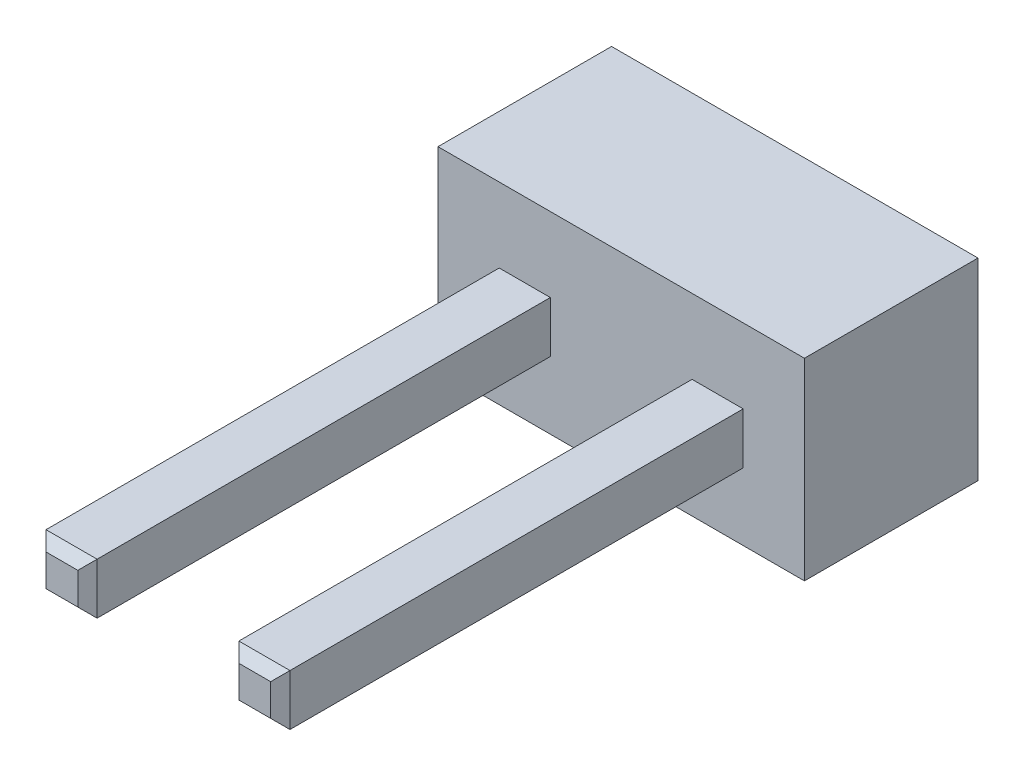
ISO-10303-21;
HEADER;
FILE_DESCRIPTION(('STEP AP214'),'2;1');
FILE_NAME('part.step','',(''),(''),'','','');
FILE_SCHEMA(('AUTOMOTIVE_DESIGN { 1 0 10303 214 1 1 1 1 }'));
ENDSEC;
DATA;
#1=APPLICATION_CONTEXT('core data for automotive mechanical design processes');
#2=APPLICATION_PROTOCOL_DEFINITION('international standard','automotive_design',2000,#1);
#3=PRODUCT_CONTEXT('',#1,'mechanical');
#4=PRODUCT('Part','Part','',(#3));
#5=PRODUCT_RELATED_PRODUCT_CATEGORY('part','',(#4));
#6=PRODUCT_DEFINITION_FORMATION('','',#4);
#7=PRODUCT_DEFINITION_CONTEXT('part definition',#1,'design');
#8=PRODUCT_DEFINITION('design','',#6,#7);
#9=PRODUCT_DEFINITION_SHAPE('','',#8);
#10=(LENGTH_UNIT() NAMED_UNIT(*) SI_UNIT(.MILLI.,.METRE.));
#11=(NAMED_UNIT(*) PLANE_ANGLE_UNIT() SI_UNIT($,.RADIAN.));
#12=(NAMED_UNIT(*) SI_UNIT($,.STERADIAN.) SOLID_ANGLE_UNIT());
#13=UNCERTAINTY_MEASURE_WITH_UNIT(LENGTH_MEASURE(1.E-05),#10,'distance_accuracy_value','');
#14=(GEOMETRIC_REPRESENTATION_CONTEXT(3) GLOBAL_UNCERTAINTY_ASSIGNED_CONTEXT((#13)) GLOBAL_UNIT_ASSIGNED_CONTEXT((#10,
#11,#12)) REPRESENTATION_CONTEXT('',''));
#15=CARTESIAN_POINT('',(0.,0.,0.));
#16=DIRECTION('',(0.,0.,1.));
#17=DIRECTION('',(1.,0.,0.));
#18=AXIS2_PLACEMENT_3D('',#15,#16,#17);
#19=CARTESIAN_POINT('',(-2.74955,1.55928543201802,7.239));
#20=DIRECTION('',(-0.707106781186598,0.,0.707106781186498));
#21=DIRECTION('',(0.707106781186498,0.,0.707106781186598));
#22=AXIS2_PLACEMENT_3D('',#19,#20,#21);
#23=PLANE('',#22);
#24=DIRECTION('',(0.,1.,0.));
#25=VECTOR('',#24,1.);
#26=CARTESIAN_POINT('',(-2.87655,1.55928543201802,7.11199999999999));
#27=LINE('',#26,#25);
#28=CARTESIAN_POINT('',(-2.87654999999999,1.55928543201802,7.11199999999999));
#29=VERTEX_POINT('',#28);
#30=CARTESIAN_POINT('',(-2.87655,0.886185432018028,7.11199999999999));
#31=VERTEX_POINT('',#30);
#32=EDGE_CURVE('E152',#29,#31,#27,.F.);
#33=ORIENTED_EDGE('',*,*,#32,.T.);
#34=DIRECTION('',(-0.577350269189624,-0.577350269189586,-0.577350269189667));
#35=VECTOR('',#34,1.);
#36=CARTESIAN_POINT('',(-2.74955,1.01318543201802,7.239));
#37=LINE('',#36,#35);
#38=CARTESIAN_POINT('',(-2.74955,1.01318543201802,7.239));
#39=VERTEX_POINT('',#38);
#40=EDGE_CURVE('E143',#39,#31,#37,.T.);
#41=ORIENTED_EDGE('',*,*,#40,.F.);
#42=DIRECTION('',(0.,1.,0.));
#43=VECTOR('',#42,1.);
#44=CARTESIAN_POINT('',(-2.74955,1.55928543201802,7.239));
#45=LINE('',#44,#43);
#46=CARTESIAN_POINT('',(-2.74955,1.43228543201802,7.239));
#47=VERTEX_POINT('',#46);
#48=EDGE_CURVE('E20',#47,#39,#45,.F.);
#49=ORIENTED_EDGE('',*,*,#48,.F.);
#50=DIRECTION('',(0.577350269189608,-0.577350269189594,0.577350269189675));
#51=VECTOR('',#50,1.);
#52=CARTESIAN_POINT('',(-2.87655,1.55928543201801,7.11199999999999));
#53=LINE('',#52,#51);
#54=EDGE_CURVE('E133',#29,#47,#53,.T.);
#55=ORIENTED_EDGE('',*,*,#54,.F.);
#56=EDGE_LOOP('',(#33,#41,#49,#55));
#57=FACE_BOUND('',#56,.T.);
#58=ADVANCED_FACE('F17',(#57),#23,.T.);
#59=CARTESIAN_POINT('',(-0.20955,0.886185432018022,7.239));
#60=DIRECTION('',(-0.707106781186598,0.,0.707106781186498));
#61=DIRECTION('',(0.707106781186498,0.,0.707106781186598));
#62=AXIS2_PLACEMENT_3D('',#59,#60,#61);
#63=PLANE('',#62);
#64=DIRECTION('',(0.,1.,0.));
#65=VECTOR('',#64,1.);
#66=CARTESIAN_POINT('',(-0.20955,0.886185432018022,7.239));
#67=LINE('',#66,#65);
#68=CARTESIAN_POINT('',(-0.20955,1.43228543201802,7.239));
#69=VERTEX_POINT('',#68);
#70=CARTESIAN_POINT('',(-0.20955,1.01318543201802,7.239));
#71=VERTEX_POINT('',#70);
#72=EDGE_CURVE('E156',#69,#71,#67,.F.);
#73=ORIENTED_EDGE('',*,*,#72,.F.);
#74=DIRECTION('',(0.577350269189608,-0.577350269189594,0.577350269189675));
#75=VECTOR('',#74,1.);
#76=CARTESIAN_POINT('',(-0.336549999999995,1.55928543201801,7.11199999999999));
#77=LINE('',#76,#75);
#78=CARTESIAN_POINT('',(-0.336549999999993,1.55928543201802,7.11199999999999));
#79=VERTEX_POINT('',#78);
#80=EDGE_CURVE('E160',#79,#69,#77,.T.);
#81=ORIENTED_EDGE('',*,*,#80,.F.);
#82=DIRECTION('',(0.,1.,0.));
#83=VECTOR('',#82,1.);
#84=CARTESIAN_POINT('',(-0.33655,1.55928543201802,7.11199999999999));
#85=LINE('',#84,#83);
#86=CARTESIAN_POINT('',(-0.336549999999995,0.886185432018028,7.11199999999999));
#87=VERTEX_POINT('',#86);
#88=EDGE_CURVE('E168',#79,#87,#85,.F.);
#89=ORIENTED_EDGE('',*,*,#88,.T.);
#90=DIRECTION('',(-0.577350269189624,-0.577350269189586,-0.577350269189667));
#91=VECTOR('',#90,1.);
#92=CARTESIAN_POINT('',(-0.20955,1.01318543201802,7.239));
#93=LINE('',#92,#91);
#94=EDGE_CURVE('E166',#71,#87,#93,.T.);
#95=ORIENTED_EDGE('',*,*,#94,.F.);
#96=EDGE_LOOP('',(#73,#81,#89,#95));
#97=FACE_BOUND('',#96,.T.);
#98=ADVANCED_FACE('F358',(#97),#63,.T.);
#99=CARTESIAN_POINT('',(-2.87655,1.55928543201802,7.239));
#100=DIRECTION('',(0.,0.,1.));
#101=DIRECTION('',(1.,0.,0.));
#102=AXIS2_PLACEMENT_3D('',#99,#100,#101);
#103=PLANE('',#102);
#104=DIRECTION('',(1.,0.,0.));
#105=VECTOR('',#104,1.);
#106=CARTESIAN_POINT('',(-2.87655,1.01318543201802,7.239));
#107=LINE('',#106,#105);
#108=CARTESIAN_POINT('',(-2.33045,1.01318543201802,7.239));
#109=VERTEX_POINT('',#108);
#110=EDGE_CURVE('E147',#109,#39,#107,.F.);
#111=ORIENTED_EDGE('',*,*,#110,.F.);
#112=DIRECTION('',(0.,1.,0.));
#113=VECTOR('',#112,1.);
#114=CARTESIAN_POINT('',(-2.33045,1.55928543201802,7.239));
#115=LINE('',#114,#113);
#116=CARTESIAN_POINT('',(-2.33045,1.43228543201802,7.239));
#117=VERTEX_POINT('',#116);
#118=EDGE_CURVE('E146',#117,#109,#115,.F.);
#119=ORIENTED_EDGE('',*,*,#118,.F.);
#120=DIRECTION('',(1.,0.,0.));
#121=VECTOR('',#120,1.);
#122=CARTESIAN_POINT('',(-2.87655,1.43228543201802,7.239));
#123=LINE('',#122,#121);
#124=EDGE_CURVE('E136',#47,#117,#123,.T.);
#125=ORIENTED_EDGE('',*,*,#124,.F.);
#126=ORIENTED_EDGE('',*,*,#48,.T.);
#127=EDGE_LOOP('',(#111,#119,#125,#126));
#128=FACE_BOUND('',#127,.T.);
#129=ADVANCED_FACE('F145',(#128),#103,.T.);
#130=CARTESIAN_POINT('',(-2.87655,1.43228543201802,7.239));
#131=DIRECTION('',(0.,0.707106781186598,0.707106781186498));
#132=DIRECTION('',(0.,-0.707106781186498,0.707106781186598));
#133=AXIS2_PLACEMENT_3D('',#130,#131,#132);
#134=PLANE('',#133);
#135=ORIENTED_EDGE('',*,*,#124,.T.);
#136=DIRECTION('',(-0.577350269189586,-0.577350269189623,0.577350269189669));
#137=VECTOR('',#136,1.);
#138=CARTESIAN_POINT('',(-2.20345000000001,1.55928543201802,7.11199999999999));
#139=LINE('',#138,#137);
#140=CARTESIAN_POINT('',(-2.20345,1.55928543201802,7.11199999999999));
#141=VERTEX_POINT('',#140);
#142=EDGE_CURVE('E173',#141,#117,#139,.T.);
#143=ORIENTED_EDGE('',*,*,#142,.F.);
#144=DIRECTION('',(1.,0.,0.));
#145=VECTOR('',#144,1.);
#146=CARTESIAN_POINT('',(-2.87655,1.55928543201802,7.11199999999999));
#147=LINE('',#146,#145);
#148=EDGE_CURVE('E138',#141,#29,#147,.F.);
#149=ORIENTED_EDGE('',*,*,#148,.T.);
#150=ORIENTED_EDGE('',*,*,#54,.T.);
#151=EDGE_LOOP('',(#135,#143,#149,#150));
#152=FACE_BOUND('',#151,.T.);
#153=ADVANCED_FACE('F134',(#152),#134,.T.);
#154=CARTESIAN_POINT('',(-2.87655,1.01318543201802,7.239));
#155=DIRECTION('',(0.,-0.707106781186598,0.707106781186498));
#156=DIRECTION('',(0.,-0.707106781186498,-0.707106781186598));
#157=AXIS2_PLACEMENT_3D('',#154,#155,#156);
#158=PLANE('',#157);
#159=ORIENTED_EDGE('',*,*,#110,.T.);
#160=ORIENTED_EDGE('',*,*,#40,.T.);
#161=DIRECTION('',(1.,0.,0.));
#162=VECTOR('',#161,1.);
#163=CARTESIAN_POINT('',(-2.87655,0.886185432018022,7.11199999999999));
#164=LINE('',#163,#162);
#165=CARTESIAN_POINT('',(-2.20345,0.886185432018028,7.11199999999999));
#166=VERTEX_POINT('',#165);
#167=EDGE_CURVE('E184',#31,#166,#164,.T.);
#168=ORIENTED_EDGE('',*,*,#167,.T.);
#169=DIRECTION('',(0.577350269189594,-0.577350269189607,-0.577350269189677));
#170=VECTOR('',#169,1.);
#171=CARTESIAN_POINT('',(-2.33045,1.01318543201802,7.239));
#172=LINE('',#171,#170);
#173=EDGE_CURVE('E176',#109,#166,#172,.T.);
#174=ORIENTED_EDGE('',*,*,#173,.F.);
#175=EDGE_LOOP('',(#159,#160,#168,#174));
#176=FACE_BOUND('',#175,.T.);
#177=ADVANCED_FACE('F350',(#176),#158,.T.);
#178=CARTESIAN_POINT('',(-2.87655,1.55928543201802,7.239));
#179=DIRECTION('',(1.,0.,0.));
#180=DIRECTION('',(0.,0.,-1.));
#181=AXIS2_PLACEMENT_3D('',#178,#179,#180);
#182=PLANE('',#181);
#183=DIRECTION('',(0.,1.,0.));
#184=VECTOR('',#183,1.);
#185=CARTESIAN_POINT('',(-2.87655,1.55928543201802,1.143));
#186=LINE('',#185,#184);
#187=CARTESIAN_POINT('',(-2.87655,0.886185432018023,1.143));
#188=VERTEX_POINT('',#187);
#189=CARTESIAN_POINT('',(-2.87655,1.55928543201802,1.143));
#190=VERTEX_POINT('',#189);
#191=EDGE_CURVE('E154',#188,#190,#186,.T.);
#192=ORIENTED_EDGE('',*,*,#191,.F.);
#193=DIRECTION('',(0.,0.,1.));
#194=VECTOR('',#193,1.);
#195=CARTESIAN_POINT('',(-2.87655,0.886185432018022,7.239));
#196=LINE('',#195,#194);
#197=EDGE_CURVE('E190',#188,#31,#196,.T.);
#198=ORIENTED_EDGE('',*,*,#197,.T.);
#199=ORIENTED_EDGE('',*,*,#32,.F.);
#200=DIRECTION('',(0.,0.,-1.));
#201=VECTOR('',#200,1.);
#202=CARTESIAN_POINT('',(-2.87655,1.55928543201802,7.239));
#203=LINE('',#202,#201);
#204=EDGE_CURVE('E179',#29,#190,#203,.T.);
#205=ORIENTED_EDGE('',*,*,#204,.T.);
#206=EDGE_LOOP('',(#192,#198,#199,#205));
#207=FACE_BOUND('',#206,.T.);
#208=ADVANCED_FACE('F346',(#207),#182,.F.);
#209=CARTESIAN_POINT('',(-0.33655,0.886185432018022,7.239));
#210=DIRECTION('',(0.,0.,1.));
#211=DIRECTION('',(1.,0.,0.));
#212=AXIS2_PLACEMENT_3D('',#209,#210,#211);
#213=PLANE('',#212);
#214=ORIENTED_EDGE('',*,*,#72,.T.);
#215=DIRECTION('',(1.,0.,0.));
#216=VECTOR('',#215,1.);
#217=CARTESIAN_POINT('',(-0.33655,1.01318543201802,7.239));
#218=LINE('',#217,#216);
#219=CARTESIAN_POINT('',(0.20955,1.01318543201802,7.239));
#220=VERTEX_POINT('',#219);
#221=EDGE_CURVE('E163',#220,#71,#218,.F.);
#222=ORIENTED_EDGE('',*,*,#221,.F.);
#223=DIRECTION('',(0.,1.,0.));
#224=VECTOR('',#223,1.);
#225=CARTESIAN_POINT('',(0.20955,0.886185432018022,7.239));
#226=LINE('',#225,#224);
#227=CARTESIAN_POINT('',(0.20955,1.43228543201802,7.239));
#228=VERTEX_POINT('',#227);
#229=EDGE_CURVE('E196',#228,#220,#226,.F.);
#230=ORIENTED_EDGE('',*,*,#229,.F.);
#231=DIRECTION('',(1.,0.,0.));
#232=VECTOR('',#231,1.);
#233=CARTESIAN_POINT('',(-0.33655,1.43228543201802,7.239));
#234=LINE('',#233,#232);
#235=EDGE_CURVE('E158',#69,#228,#234,.T.);
#236=ORIENTED_EDGE('',*,*,#235,.F.);
#237=EDGE_LOOP('',(#214,#222,#230,#236));
#238=FACE_BOUND('',#237,.T.);
#239=ADVANCED_FACE('F342',(#238),#213,.T.);
#240=CARTESIAN_POINT('',(-0.33655,1.43228543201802,7.239));
#241=DIRECTION('',(0.,0.707106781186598,0.707106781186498));
#242=DIRECTION('',(0.,-0.707106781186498,0.707106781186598));
#243=AXIS2_PLACEMENT_3D('',#240,#241,#242);
#244=PLANE('',#243);
#245=DIRECTION('',(1.,0.,0.));
#246=VECTOR('',#245,1.);
#247=CARTESIAN_POINT('',(-0.33655,1.55928543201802,7.11199999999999));
#248=LINE('',#247,#246);
#249=CARTESIAN_POINT('',(0.336549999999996,1.55928543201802,7.11199999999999));
#250=VERTEX_POINT('',#249);
#251=EDGE_CURVE('E200',#250,#79,#248,.F.);
#252=ORIENTED_EDGE('',*,*,#251,.T.);
#253=ORIENTED_EDGE('',*,*,#80,.T.);
#254=ORIENTED_EDGE('',*,*,#235,.T.);
#255=DIRECTION('',(-0.577350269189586,-0.577350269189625,0.577350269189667));
#256=VECTOR('',#255,1.);
#257=CARTESIAN_POINT('',(0.33654999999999,1.55928543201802,7.11199999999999));
#258=LINE('',#257,#256);
#259=EDGE_CURVE('E193',#250,#228,#258,.T.);
#260=ORIENTED_EDGE('',*,*,#259,.F.);
#261=EDGE_LOOP('',(#252,#253,#254,#260));
#262=FACE_BOUND('',#261,.T.);
#263=ADVANCED_FACE('F338',(#262),#244,.T.);
#264=CARTESIAN_POINT('',(-0.33655,1.01318543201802,7.239));
#265=DIRECTION('',(0.,-0.707106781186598,0.707106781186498));
#266=DIRECTION('',(0.,-0.707106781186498,-0.707106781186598));
#267=AXIS2_PLACEMENT_3D('',#264,#265,#266);
#268=PLANE('',#267);
#269=ORIENTED_EDGE('',*,*,#221,.T.);
#270=ORIENTED_EDGE('',*,*,#94,.T.);
#271=DIRECTION('',(1.,0.,0.));
#272=VECTOR('',#271,1.);
#273=CARTESIAN_POINT('',(-0.33655,0.886185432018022,7.11199999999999));
#274=LINE('',#273,#272);
#275=CARTESIAN_POINT('',(0.336549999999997,0.886185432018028,7.11199999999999));
#276=VERTEX_POINT('',#275);
#277=EDGE_CURVE('E208',#87,#276,#274,.T.);
#278=ORIENTED_EDGE('',*,*,#277,.T.);
#279=DIRECTION('',(0.577350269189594,-0.577350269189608,-0.577350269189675));
#280=VECTOR('',#279,1.);
#281=CARTESIAN_POINT('',(0.20955,1.01318543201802,7.239));
#282=LINE('',#281,#280);
#283=EDGE_CURVE('E198',#220,#276,#282,.T.);
#284=ORIENTED_EDGE('',*,*,#283,.F.);
#285=EDGE_LOOP('',(#269,#270,#278,#284));
#286=FACE_BOUND('',#285,.T.);
#287=ADVANCED_FACE('F334',(#286),#268,.T.);
#288=CARTESIAN_POINT('',(-0.33655,1.55928543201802,7.239));
#289=DIRECTION('',(1.,0.,0.));
#290=DIRECTION('',(0.,0.,-1.));
#291=AXIS2_PLACEMENT_3D('',#288,#289,#290);
#292=PLANE('',#291);
#293=DIRECTION('',(0.,1.,0.));
#294=VECTOR('',#293,1.);
#295=CARTESIAN_POINT('',(-0.33655,1.55928543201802,1.143));
#296=LINE('',#295,#294);
#297=CARTESIAN_POINT('',(-0.33655,0.886185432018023,1.143));
#298=VERTEX_POINT('',#297);
#299=CARTESIAN_POINT('',(-0.336549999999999,1.55928543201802,1.143));
#300=VERTEX_POINT('',#299);
#301=EDGE_CURVE('E171',#298,#300,#296,.T.);
#302=ORIENTED_EDGE('',*,*,#301,.F.);
#303=DIRECTION('',(0.,0.,1.));
#304=VECTOR('',#303,1.);
#305=CARTESIAN_POINT('',(-0.33655,0.886185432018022,7.239));
#306=LINE('',#305,#304);
#307=EDGE_CURVE('E214',#298,#87,#306,.T.);
#308=ORIENTED_EDGE('',*,*,#307,.T.);
#309=ORIENTED_EDGE('',*,*,#88,.F.);
#310=DIRECTION('',(0.,0.,-1.));
#311=VECTOR('',#310,1.);
#312=CARTESIAN_POINT('',(-0.336549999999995,1.55928543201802,7.239));
#313=LINE('',#312,#311);
#314=EDGE_CURVE('E203',#79,#300,#313,.T.);
#315=ORIENTED_EDGE('',*,*,#314,.T.);
#316=EDGE_LOOP('',(#302,#308,#309,#315));
#317=FACE_BOUND('',#316,.T.);
#318=ADVANCED_FACE('F330',(#317),#292,.F.);
#319=CARTESIAN_POINT('',(-2.33045,1.55928543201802,7.239));
#320=DIRECTION('',(0.707106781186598,0.,0.707106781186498));
#321=DIRECTION('',(0.707106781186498,0.,-0.707106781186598));
#322=AXIS2_PLACEMENT_3D('',#319,#320,#321);
#323=PLANE('',#322);
#324=ORIENTED_EDGE('',*,*,#118,.T.);
#325=ORIENTED_EDGE('',*,*,#173,.T.);
#326=DIRECTION('',(0.,1.,0.));
#327=VECTOR('',#326,1.);
#328=CARTESIAN_POINT('',(-2.20345,1.55928543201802,7.11199999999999));
#329=LINE('',#328,#327);
#330=EDGE_CURVE('E217',#166,#141,#329,.T.);
#331=ORIENTED_EDGE('',*,*,#330,.T.);
#332=ORIENTED_EDGE('',*,*,#142,.T.);
#333=EDGE_LOOP('',(#324,#325,#331,#332));
#334=FACE_BOUND('',#333,.T.);
#335=ADVANCED_FACE('F326',(#334),#323,.T.);
#336=CARTESIAN_POINT('',(-2.87655,1.55928543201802,7.239));
#337=DIRECTION('',(0.,-1.,0.));
#338=DIRECTION('',(0.,0.,-1.));
#339=AXIS2_PLACEMENT_3D('',#336,#337,#338);
#340=PLANE('',#339);
#341=DIRECTION('',(1.,0.,0.));
#342=VECTOR('',#341,1.);
#343=CARTESIAN_POINT('',(-2.87655,1.55928543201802,1.143));
#344=LINE('',#343,#342);
#345=CARTESIAN_POINT('',(-2.20345,1.55928543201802,1.143));
#346=VERTEX_POINT('',#345);
#347=EDGE_CURVE('E182',#190,#346,#344,.T.);
#348=ORIENTED_EDGE('',*,*,#347,.F.);
#349=ORIENTED_EDGE('',*,*,#204,.F.);
#350=ORIENTED_EDGE('',*,*,#148,.F.);
#351=DIRECTION('',(0.,0.,1.));
#352=VECTOR('',#351,1.);
#353=CARTESIAN_POINT('',(-2.20345,1.55928543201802,7.239));
#354=LINE('',#353,#352);
#355=EDGE_CURVE('E220',#141,#346,#354,.F.);
#356=ORIENTED_EDGE('',*,*,#355,.T.);
#357=EDGE_LOOP('',(#348,#349,#350,#356));
#358=FACE_BOUND('',#357,.T.);
#359=ADVANCED_FACE('F322',(#358),#340,.F.);
#360=CARTESIAN_POINT('',(-2.87655,0.886185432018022,7.239));
#361=DIRECTION('',(0.,1.,0.));
#362=DIRECTION('',(0.,0.,1.));
#363=AXIS2_PLACEMENT_3D('',#360,#361,#362);
#364=PLANE('',#363);
#365=DIRECTION('',(1.,0.,0.));
#366=VECTOR('',#365,1.);
#367=CARTESIAN_POINT('',(-2.87655,0.886185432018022,1.143));
#368=LINE('',#367,#366);
#369=CARTESIAN_POINT('',(-2.20345,0.886185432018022,1.143));
#370=VERTEX_POINT('',#369);
#371=EDGE_CURVE('E187',#370,#188,#368,.F.);
#372=ORIENTED_EDGE('',*,*,#371,.F.);
#373=DIRECTION('',(0.,0.,1.));
#374=VECTOR('',#373,1.);
#375=CARTESIAN_POINT('',(-2.20345,0.886185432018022,7.239));
#376=LINE('',#375,#374);
#377=EDGE_CURVE('E223',#370,#166,#376,.T.);
#378=ORIENTED_EDGE('',*,*,#377,.T.);
#379=ORIENTED_EDGE('',*,*,#167,.F.);
#380=ORIENTED_EDGE('',*,*,#197,.F.);
#381=EDGE_LOOP('',(#372,#378,#379,#380));
#382=FACE_BOUND('',#381,.T.);
#383=ADVANCED_FACE('F318',(#382),#364,.F.);
#384=CARTESIAN_POINT('',(0.20955,0.886185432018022,7.239));
#385=DIRECTION('',(0.707106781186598,0.,0.707106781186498));
#386=DIRECTION('',(0.707106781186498,0.,-0.707106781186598));
#387=AXIS2_PLACEMENT_3D('',#384,#385,#386);
#388=PLANE('',#387);
#389=ORIENTED_EDGE('',*,*,#229,.T.);
#390=ORIENTED_EDGE('',*,*,#283,.T.);
#391=DIRECTION('',(0.,1.,0.));
#392=VECTOR('',#391,1.);
#393=CARTESIAN_POINT('',(0.33655,1.55928543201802,7.11199999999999));
#394=LINE('',#393,#392);
#395=EDGE_CURVE('E226',#276,#250,#394,.T.);
#396=ORIENTED_EDGE('',*,*,#395,.T.);
#397=ORIENTED_EDGE('',*,*,#259,.T.);
#398=EDGE_LOOP('',(#389,#390,#396,#397));
#399=FACE_BOUND('',#398,.T.);
#400=ADVANCED_FACE('F314',(#399),#388,.T.);
#401=CARTESIAN_POINT('',(-0.33655,1.55928543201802,7.239));
#402=DIRECTION('',(0.,-1.,0.));
#403=DIRECTION('',(0.,0.,-1.));
#404=AXIS2_PLACEMENT_3D('',#401,#402,#403);
#405=PLANE('',#404);
#406=DIRECTION('',(1.,0.,0.));
#407=VECTOR('',#406,1.);
#408=CARTESIAN_POINT('',(-0.33655,1.55928543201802,1.143));
#409=LINE('',#408,#407);
#410=CARTESIAN_POINT('',(0.33655,1.55928543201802,1.143));
#411=VERTEX_POINT('',#410);
#412=EDGE_CURVE('E206',#300,#411,#409,.T.);
#413=ORIENTED_EDGE('',*,*,#412,.F.);
#414=ORIENTED_EDGE('',*,*,#314,.F.);
#415=ORIENTED_EDGE('',*,*,#251,.F.);
#416=DIRECTION('',(0.,0.,1.));
#417=VECTOR('',#416,1.);
#418=CARTESIAN_POINT('',(0.33655,1.55928543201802,7.239));
#419=LINE('',#418,#417);
#420=EDGE_CURVE('E229',#250,#411,#419,.F.);
#421=ORIENTED_EDGE('',*,*,#420,.T.);
#422=EDGE_LOOP('',(#413,#414,#415,#421));
#423=FACE_BOUND('',#422,.T.);
#424=ADVANCED_FACE('F310',(#423),#405,.F.);
#425=CARTESIAN_POINT('',(-0.33655,0.886185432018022,7.239));
#426=DIRECTION('',(0.,1.,0.));
#427=DIRECTION('',(0.,0.,1.));
#428=AXIS2_PLACEMENT_3D('',#425,#426,#427);
#429=PLANE('',#428);
#430=DIRECTION('',(1.,0.,0.));
#431=VECTOR('',#430,1.);
#432=CARTESIAN_POINT('',(-0.33655,0.886185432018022,1.143));
#433=LINE('',#432,#431);
#434=CARTESIAN_POINT('',(0.336549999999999,0.886185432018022,1.143));
#435=VERTEX_POINT('',#434);
#436=EDGE_CURVE('E211',#435,#298,#433,.F.);
#437=ORIENTED_EDGE('',*,*,#436,.F.);
#438=DIRECTION('',(0.,0.,1.));
#439=VECTOR('',#438,1.);
#440=CARTESIAN_POINT('',(0.33655,0.886185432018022,7.239));
#441=LINE('',#440,#439);
#442=EDGE_CURVE('E232',#435,#276,#441,.T.);
#443=ORIENTED_EDGE('',*,*,#442,.T.);
#444=ORIENTED_EDGE('',*,*,#277,.F.);
#445=ORIENTED_EDGE('',*,*,#307,.F.);
#446=EDGE_LOOP('',(#437,#443,#444,#445));
#447=FACE_BOUND('',#446,.T.);
#448=ADVANCED_FACE('F306',(#447),#429,.F.);
#449=CARTESIAN_POINT('',(-2.20345,1.55928543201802,7.239));
#450=DIRECTION('',(-1.,0.,0.));
#451=DIRECTION('',(0.,0.,1.));
#452=AXIS2_PLACEMENT_3D('',#449,#450,#451);
#453=PLANE('',#452);
#454=DIRECTION('',(0.,1.,0.));
#455=VECTOR('',#454,1.);
#456=CARTESIAN_POINT('',(-2.20345,2.54,1.143));
#457=LINE('',#456,#455);
#458=EDGE_CURVE('E235',#370,#346,#457,.T.);
#459=ORIENTED_EDGE('',*,*,#458,.T.);
#460=ORIENTED_EDGE('',*,*,#355,.F.);
#461=ORIENTED_EDGE('',*,*,#330,.F.);
#462=ORIENTED_EDGE('',*,*,#377,.F.);
#463=EDGE_LOOP('',(#459,#460,#461,#462));
#464=FACE_BOUND('',#463,.T.);
#465=ADVANCED_FACE('F302',(#464),#453,.F.);
#466=CARTESIAN_POINT('',(0.33655,1.55928543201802,7.239));
#467=DIRECTION('',(-1.,0.,0.));
#468=DIRECTION('',(0.,0.,1.));
#469=AXIS2_PLACEMENT_3D('',#466,#467,#468);
#470=PLANE('',#469);
#471=DIRECTION('',(0.,1.,0.));
#472=VECTOR('',#471,1.);
#473=CARTESIAN_POINT('',(0.33655,2.54,1.143));
#474=LINE('',#473,#472);
#475=EDGE_CURVE('E238',#435,#411,#474,.T.);
#476=ORIENTED_EDGE('',*,*,#475,.T.);
#477=ORIENTED_EDGE('',*,*,#420,.F.);
#478=ORIENTED_EDGE('',*,*,#395,.F.);
#479=ORIENTED_EDGE('',*,*,#442,.F.);
#480=EDGE_LOOP('',(#476,#477,#478,#479));
#481=FACE_BOUND('',#480,.T.);
#482=ADVANCED_FACE('F298',(#481),#470,.F.);
#483=CARTESIAN_POINT('',(-3.683,2.54,1.143));
#484=DIRECTION('',(0.,0.,-1.));
#485=DIRECTION('',(-1.,0.,0.));
#486=AXIS2_PLACEMENT_3D('',#483,#484,#485);
#487=PLANE('',#486);
#488=DIRECTION('',(0.,1.,0.));
#489=VECTOR('',#488,1.);
#490=CARTESIAN_POINT('',(-3.683,2.54,1.143));
#491=LINE('',#490,#489);
#492=CARTESIAN_POINT('',(-3.683,2.54,1.143));
#493=VERTEX_POINT('',#492);
#494=CARTESIAN_POINT('',(-3.683,0.,1.143));
#495=VERTEX_POINT('',#494);
#496=EDGE_CURVE('E248',#493,#495,#491,.F.);
#497=ORIENTED_EDGE('',*,*,#496,.T.);
#498=DIRECTION('',(1.,0.,0.));
#499=VECTOR('',#498,1.);
#500=CARTESIAN_POINT('',(-3.683,0.,1.143));
#501=LINE('',#500,#499);
#502=CARTESIAN_POINT('',(1.143,0.,1.143));
#503=VERTEX_POINT('',#502);
#504=EDGE_CURVE('E257',#495,#503,#501,.T.);
#505=ORIENTED_EDGE('',*,*,#504,.T.);
#506=DIRECTION('',(0.,1.,0.));
#507=VECTOR('',#506,1.);
#508=CARTESIAN_POINT('',(1.143,2.78260682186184,1.143));
#509=LINE('',#508,#507);
#510=CARTESIAN_POINT('',(1.143,2.54,1.143));
#511=VERTEX_POINT('',#510);
#512=EDGE_CURVE('E241',#503,#511,#509,.T.);
#513=ORIENTED_EDGE('',*,*,#512,.T.);
#514=DIRECTION('',(1.,0.,0.));
#515=VECTOR('',#514,1.);
#516=CARTESIAN_POINT('',(-3.683,2.54,1.143));
#517=LINE('',#516,#515);
#518=EDGE_CURVE('E244',#493,#511,#517,.T.);
#519=ORIENTED_EDGE('',*,*,#518,.F.);
#520=EDGE_LOOP('',(#497,#505,#513,#519));
#521=FACE_BOUND('',#520,.T.);
#522=ORIENTED_EDGE('',*,*,#436,.T.);
#523=ORIENTED_EDGE('',*,*,#301,.T.);
#524=ORIENTED_EDGE('',*,*,#412,.T.);
#525=ORIENTED_EDGE('',*,*,#475,.F.);
#526=EDGE_LOOP('',(#522,#523,#524,#525));
#527=FACE_BOUND('',#526,.T.);
#528=ORIENTED_EDGE('',*,*,#371,.T.);
#529=ORIENTED_EDGE('',*,*,#191,.T.);
#530=ORIENTED_EDGE('',*,*,#347,.T.);
#531=ORIENTED_EDGE('',*,*,#458,.F.);
#532=EDGE_LOOP('',(#528,#529,#530,#531));
#533=FACE_BOUND('',#532,.T.);
#534=ADVANCED_FACE('F295',(#521,#527,#533),#487,.F.);
#535=CARTESIAN_POINT('',(1.143,2.78260682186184,-1.397));
#536=DIRECTION('',(-1.,0.,0.));
#537=DIRECTION('',(0.,0.,1.));
#538=AXIS2_PLACEMENT_3D('',#535,#536,#537);
#539=PLANE('',#538);
#540=DIRECTION('',(0.,1.,0.));
#541=VECTOR('',#540,1.);
#542=CARTESIAN_POINT('',(1.143,2.54,-1.143));
#543=LINE('',#542,#541);
#544=CARTESIAN_POINT('',(1.143,0.,-1.143));
#545=VERTEX_POINT('',#544);
#546=CARTESIAN_POINT('',(1.143,2.54,-1.143));
#547=VERTEX_POINT('',#546);
#548=EDGE_CURVE('E260',#545,#547,#543,.T.);
#549=ORIENTED_EDGE('',*,*,#548,.T.);
#550=DIRECTION('',(0.,0.,1.));
#551=VECTOR('',#550,1.);
#552=CARTESIAN_POINT('',(1.143,2.54,1.143));
#553=LINE('',#552,#551);
#554=EDGE_CURVE('E246',#511,#547,#553,.F.);
#555=ORIENTED_EDGE('',*,*,#554,.F.);
#556=ORIENTED_EDGE('',*,*,#512,.F.);
#557=DIRECTION('',(0.,0.,1.));
#558=VECTOR('',#557,1.);
#559=CARTESIAN_POINT('',(1.143,0.,1.143));
#560=LINE('',#559,#558);
#561=EDGE_CURVE('E253',#503,#545,#560,.F.);
#562=ORIENTED_EDGE('',*,*,#561,.T.);
#563=EDGE_LOOP('',(#549,#555,#556,#562));
#564=FACE_BOUND('',#563,.T.);
#565=ADVANCED_FACE('F278',(#564),#539,.F.);
#566=CARTESIAN_POINT('',(-3.683,2.54,1.143));
#567=DIRECTION('',(0.,1.,0.));
#568=DIRECTION('',(0.,0.,1.));
#569=AXIS2_PLACEMENT_3D('',#566,#567,#568);
#570=PLANE('',#569);
#571=ORIENTED_EDGE('',*,*,#518,.T.);
#572=ORIENTED_EDGE('',*,*,#554,.T.);
#573=DIRECTION('',(1.,0.,0.));
#574=VECTOR('',#573,1.);
#575=CARTESIAN_POINT('',(-3.683,2.54,-1.143));
#576=LINE('',#575,#574);
#577=CARTESIAN_POINT('',(-3.683,2.54,-1.143));
#578=VERTEX_POINT('',#577);
#579=EDGE_CURVE('E263',#547,#578,#576,.F.);
#580=ORIENTED_EDGE('',*,*,#579,.T.);
#581=DIRECTION('',(0.,0.,-1.));
#582=VECTOR('',#581,1.);
#583=CARTESIAN_POINT('',(-3.683,2.54,-1.143));
#584=LINE('',#583,#582);
#585=EDGE_CURVE('E250',#578,#493,#584,.F.);
#586=ORIENTED_EDGE('',*,*,#585,.T.);
#587=EDGE_LOOP('',(#571,#572,#580,#586));
#588=FACE_BOUND('',#587,.T.);
#589=ADVANCED_FACE('F274',(#588),#570,.T.);
#590=CARTESIAN_POINT('',(-3.683,2.54,-1.143));
#591=DIRECTION('',(1.,0.,0.));
#592=DIRECTION('',(0.,0.,-1.));
#593=AXIS2_PLACEMENT_3D('',#590,#591,#592);
#594=PLANE('',#593);
#595=DIRECTION('',(0.,1.,0.));
#596=VECTOR('',#595,1.);
#597=CARTESIAN_POINT('',(-3.683,2.54,-1.143));
#598=LINE('',#597,#596);
#599=CARTESIAN_POINT('',(-3.683,0.,-1.143));
#600=VERTEX_POINT('',#599);
#601=EDGE_CURVE('E26',#578,#600,#598,.F.);
#602=ORIENTED_EDGE('',*,*,#601,.T.);
#603=DIRECTION('',(0.,0.,1.));
#604=VECTOR('',#603,1.);
#605=CARTESIAN_POINT('',(-3.683,0.,1.143));
#606=LINE('',#605,#604);
#607=EDGE_CURVE('E34',#600,#495,#606,.T.);
#608=ORIENTED_EDGE('',*,*,#607,.T.);
#609=ORIENTED_EDGE('',*,*,#496,.F.);
#610=ORIENTED_EDGE('',*,*,#585,.F.);
#611=EDGE_LOOP('',(#602,#608,#609,#610));
#612=FACE_BOUND('',#611,.T.);
#613=ADVANCED_FACE('F269',(#612),#594,.F.);
#614=CARTESIAN_POINT('',(-3.683,0.,1.143));
#615=DIRECTION('',(0.,1.,0.));
#616=DIRECTION('',(0.,0.,1.));
#617=AXIS2_PLACEMENT_3D('',#614,#615,#616);
#618=PLANE('',#617);
#619=ORIENTED_EDGE('',*,*,#607,.F.);
#620=DIRECTION('',(1.,0.,0.));
#621=VECTOR('',#620,1.);
#622=CARTESIAN_POINT('',(-3.683,0.,-1.143));
#623=LINE('',#622,#621);
#624=EDGE_CURVE('E11',#600,#545,#623,.T.);
#625=ORIENTED_EDGE('',*,*,#624,.T.);
#626=ORIENTED_EDGE('',*,*,#561,.F.);
#627=ORIENTED_EDGE('',*,*,#504,.F.);
#628=EDGE_LOOP('',(#619,#625,#626,#627));
#629=FACE_BOUND('',#628,.T.);
#630=ADVANCED_FACE('F280',(#629),#618,.F.);
#631=CARTESIAN_POINT('',(-3.683,2.54,-1.143));
#632=DIRECTION('',(0.,0.,1.));
#633=DIRECTION('',(1.,0.,0.));
#634=AXIS2_PLACEMENT_3D('',#631,#632,#633);
#635=PLANE('',#634);
#636=ORIENTED_EDGE('',*,*,#601,.F.);
#637=ORIENTED_EDGE('',*,*,#579,.F.);
#638=ORIENTED_EDGE('',*,*,#548,.F.);
#639=ORIENTED_EDGE('',*,*,#624,.F.);
#640=EDGE_LOOP('',(#636,#637,#638,#639));
#641=FACE_BOUND('',#640,.T.);
#642=ADVANCED_FACE('F272',(#641),#635,.F.);
#643=CLOSED_SHELL('',(#58,#98,#129,#153,#177,#208,#239,#263,#287,#318,#335,#359,#383,#400,#424,
#448,#465,#482,#534,#565,#589,#613,#630,#642));
#644=MANIFOLD_SOLID_BREP('B1',#643);
#645=ADVANCED_BREP_SHAPE_REPRESENTATION('',(#18,#644),#14);
#646=SHAPE_DEFINITION_REPRESENTATION(#9,#645);
ENDSEC;
END-ISO-10303-21;
